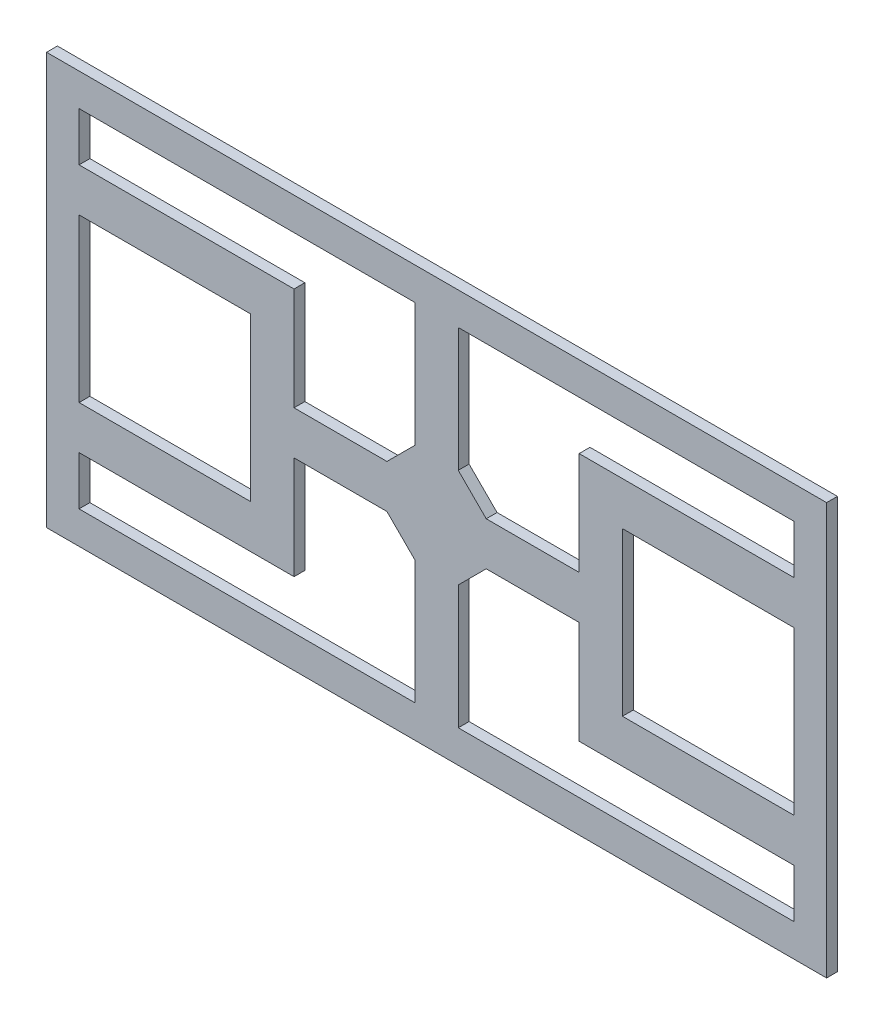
from build123d import *

# Parameters (mm, degrees)
SKETCH1_W           = 914.4
SKETCH1_H           = 482.6
SKETCH1_W_2         = 201.194736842
SKETCH1_H_2         = 190.5
BOSS_EXTRUDE1_DEPTH = 12.7


with BuildPart() as part:
    # Sketch1 → Boss-Extrude1 (new body)
    with BuildSketch(Plane.XY):
        Rectangle(SKETCH1_W, SKETCH1_H)
        Polygon((-419.1, 203.2), (-25.4, 203.2), (-25.4, 58.198711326), (-58.198711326, 25.4), (-167.105263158, 25.4), (-167.105263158, 146.05), (-419.1, 146.05), align=None, mode=Mode.SUBTRACT)
        with Locations((-318.502631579, 0)):
            Rectangle(SKETCH1_W_2, SKETCH1_H_2, mode=Mode.SUBTRACT)
        Polygon((419.1, 146.05), (419.1, 203.2), (25.4, 203.2), (25.4, 58.198711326), (58.198711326, 25.4), (167.105263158, 25.4), (167.105263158, 146.05), align=None, mode=Mode.SUBTRACT)
        with Locations((318.502631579, 0)):
            Rectangle(SKETCH1_W_2, SKETCH1_H_2, mode=Mode.SUBTRACT)
        Polygon((-419.1, -146.05), (-419.1, -203.2), (-25.4, -203.2), (-25.4, -58.198711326), (-58.198711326, -25.4), (-167.105263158, -25.4), (-167.105263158, -146.05), align=None, mode=Mode.SUBTRACT)
        Polygon((25.4, -203.2), (25.4, -58.198711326), (58.198711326, -25.4), (167.105263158, -25.4), (167.105263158, -146.05), (419.1, -146.05), (419.1, -203.2), align=None, mode=Mode.SUBTRACT)
    extrude(amount=BOSS_EXTRUDE1_DEPTH)


solid = part.part
